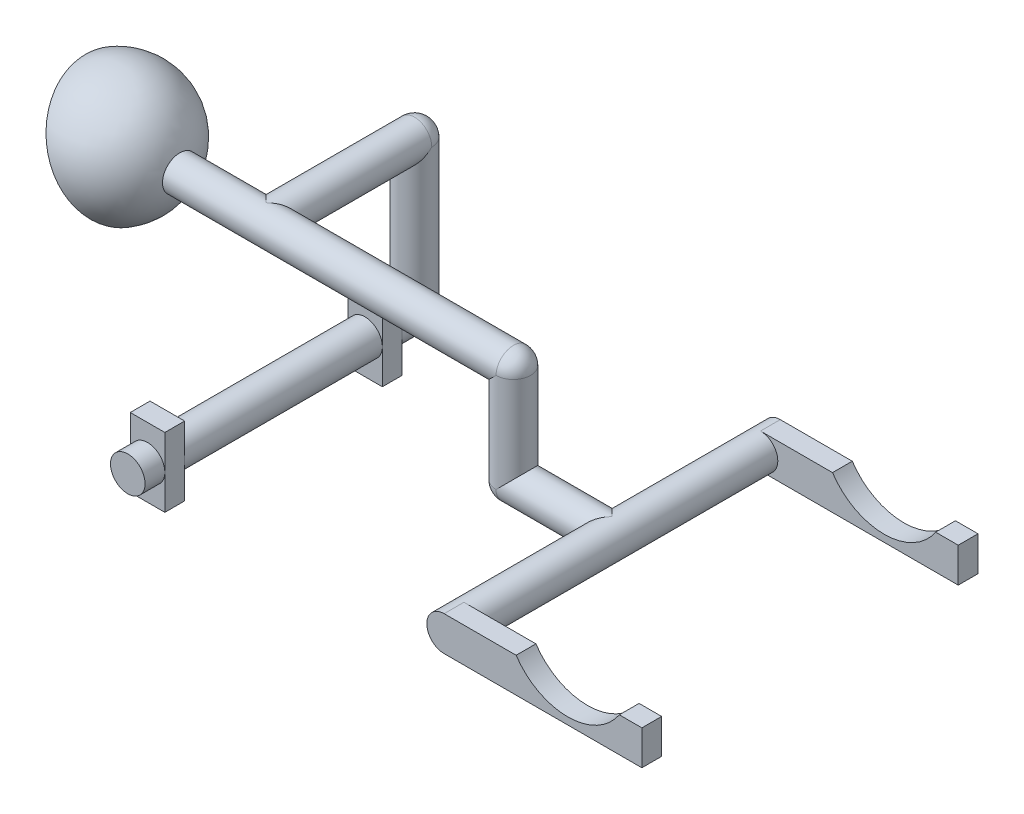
from build123d import *

# Parameters (mm, degrees)
EXTRUSION1_DEPTH             = 50
EXTRUSION1_DEPTH_BACK        = 30
ESQUISSE1_R                  = 3.5
ESQUISSE2_R                  = 3.5
EXTRUSION2_DEPTH             = 30
ESQUISSE3_R                  = 3.5
EXTRUSION3_DEPTH             = 30
ESQUISSE4_W                  = 6
ESQUISSE4_H                  = 3.5
ESQUISSE5_W                  = 7
ESQUISSE5_H                  = 14
EXTRUSION4_DEPTH             = 4
EXTRUSION5_DEPTH             = 40
EXTRUSION6_DEPTH             = 4
EXTRUSION7_DEPTH             = 4
ESQUISSE11_R                 = 3.5
EXTRUSION8_DEPTH             = 20
ESQUISSE12_W                 = 20
ESQUISSE12_H                 = 3.5
EXTRUSION9_DEPTH             = 30
EXTRUSION9_DEPTH_BACK        = 30
ESQUISSE13_R                 = 3.5
EXTRUSION10_DEPTH            = 4
ENL_V_MAT_EXTRU_1_DEPTH      = 24
ENL_V_MAT_EXTRU_1_DEPTH_BACK = 24


with BuildPart() as part:
    # Esquisse1 → Extrusion1 (new, two sides: drawn at the far end of the back side and taken through both)
    with BuildSketch(Plane(origin=(0, 0, 0), x_dir=(0, 0, -1), z_dir=(1, 0, 0)).offset(-EXTRUSION1_DEPTH_BACK)):
        Circle(ESQUISSE1_R)
    extrude(amount=EXTRUSION1_DEPTH + EXTRUSION1_DEPTH_BACK)

    # Esquisse2 → Extrusion2 (add)
    with BuildSketch(Plane.XY):
        Circle(ESQUISSE2_R)
    extrude(amount=-EXTRUSION2_DEPTH)

    # Esquisse3 → Extrusion3 (add)
    with BuildSketch(Plane(origin=(0, 0, 0), x_dir=(1, 0, 0), z_dir=(0, 1, 0))):
        with Locations(Location((0, 30, 0), (0, 0, 270))):
            Circle(ESQUISSE3_R)
    extrude(amount=-EXTRUSION3_DEPTH)

    # Esquisse4 → R_volution1 (revolve)
    with BuildSketch(Plane(origin=(0, 0, 0), x_dir=(0, 0, -1), z_dir=(1, 0, 0))):
        with Locations((27, -28.25)):
            Rectangle(ESQUISSE4_W, ESQUISSE4_H)
    revolve(axis=Axis((0, -30, -33.30321635), (0, 0, 1)))

    # Esquisse5 → Extrusion4 (add)
    with BuildSketch(Plane.XY.offset(-24)):
        with Locations((0, -30)):
            Rectangle(ESQUISSE5_W, ESQUISSE5_H)
    extrude(amount=EXTRUSION4_DEPTH)

    # Esquisse6 → Extrusion5 (add)
    with BuildSketch(Plane.XY.offset(-20)):
        with BuildLine():
            ThreePointArc((-3.5, -30), (0, -33.5), (3.5, -30))
            ThreePointArc((3.5, -30), (0, -26.5), (-3.5, -30))
        make_face()
    extrude(amount=EXTRUSION5_DEPTH)

    # Esquisse7 → Extrusion6 (add)
    with BuildSketch(Plane.XY.offset(20)):
        Polygon((-3.5, -30), (-3.5, -37), (3.5, -37), (3.5, -30), (3.5, -23), (-3.5, -23), align=None)
    extrude(amount=EXTRUSION6_DEPTH)

    # Esquisse8 → Extrusion7 (add)
    with BuildSketch(Plane.XY.offset(24)):
        with BuildLine():
            ThreePointArc((-3.5, -30), (0, -33.5), (3.5, -30))
            ThreePointArc((3.5, -30), (0, -26.5), (-3.5, -30))
        make_face()
    extrude(amount=EXTRUSION7_DEPTH)

    # Esquisse9 → R_volution2 (revolve)
    with BuildSketch(Plane.XY):
        with BuildLine():
            Line((-30, 13), (-30, -13))
            ThreePointArc((-30, -13), (-17, 0), (-30, 13))
        make_face()
    revolve(axis=Axis((-30, 18.638660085, 0), (0, -1, 0)))

    # Esquisse11 → Extrusion8 (add)
    with BuildSketch(Plane(origin=(0, 0, 0), x_dir=(1, 0, 0), z_dir=(0, 1, 0))):
        with Locations(Location((50, 0, 0), (0, 0, 270))):
            Circle(ESQUISSE11_R)
    extrude(amount=-EXTRUSION8_DEPTH)

    # Esquisse12 → R_volution3 (revolve)
    with BuildSketch(Plane.XY, mode=Mode.PRIVATE) as r_volution3_sk:
        with Locations((60, -18.25)):
            Rectangle(ESQUISSE12_W, ESQUISSE12_H)
    revolve(r_volution3_sk.sketch.rotate(Axis((34.93531801, -20, 0), (1, 0, 0)), 90), axis=Axis((34.93531801, -20, 0), (1, 0, 0)))

    # Esquisse13 → Extrusion9 (add, two sides: drawn at the far end of the back side and taken through both)
    with BuildSketch(Plane.XY.offset(-EXTRUSION9_DEPTH_BACK)):
        with Locations((70, -20)):
            Circle(ESQUISSE13_R)
    extrude(amount=EXTRUSION9_DEPTH + EXTRUSION9_DEPTH_BACK)

    # Esquisse14 → Extrusion10 (add)
    with BuildSketch(Plane.XY.offset(30)):
        with BuildLine():
            Line((70, -16.5), (84.564979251, -16.5))
            ThreePointArc((84.564979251, -16.5), (95, -22.077550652), (105.435020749, -16.5))
            Line((105.435020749, -16.5), (110, -16.5))
            Line((110, -16.5), (110, -23.5))
            Line((110, -23.5), (70, -23.5))
            ThreePointArc((70, -23.5), (66.5, -20), (70, -16.5))
        make_face()
    extrusion10 = extrude(amount=EXTRUSION10_DEPTH)

    # Sym_trie1: Extrusion10 across plane
    add(extrusion10.mirror(Plane.XY))

    # Esquisse15 → Enl_v. mat.-Extru.1 (cut, two sides: drawn at the far end of the back side and taken through both)
    with BuildSketch(Plane.XY.offset(-ENL_V_MAT_EXTRU_1_DEPTH_BACK)):
        with BuildLine():
            Line((-36.528694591, 11.241714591), (-23.471305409, -11.241714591))
            ThreePointArc((-23.471305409, -11.241714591), (-41.241714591, -6.528694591), (-36.528694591, 11.241714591))
        make_face()
    extrude(amount=ENL_V_MAT_EXTRU_1_DEPTH + ENL_V_MAT_EXTRU_1_DEPTH_BACK, mode=Mode.SUBTRACT)

    # Esquisse16 → Enl_vement de mati_re-R_volution1 (revolve, cut)
    with BuildSketch(Plane.XY):
        with BuildLine():
            Line((-40, 0), (-20, 0))
            ThreePointArc((-20, 0), (-30, 10), (-40, 0))
        make_face()
    revolve(axis=Axis((-45.600915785, 0, 0), (1, 0, 0)), mode=Mode.SUBTRACT)

    # Esquisse17 → R_volution4 (revolve)
    with BuildSketch(Plane(origin=(0, 0, -30), x_dir=(-1, 0, 0), z_dir=(0, 0, -1))):
        with BuildLine():
            Line((-3.5, 0), (3.5, 0))
            ThreePointArc((3.5, 0), (0, 3.5), (-3.5, 0))
        make_face()
    revolve(axis=Axis((11.869625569, 0, -30), (-1, 0, 0)))

    # Esquisse18 → R_volution5 (revolve)
    with BuildSketch(Plane(origin=(0, 0, -30), x_dir=(-1, 0, 0), z_dir=(0, 0, -1))):
        with BuildLine():
            Line((3.5, -30), (-3.5, -30))
            ThreePointArc((-3.5, -30), (0, -33.5), (3.5, -30))
        make_face()
    revolve(axis=Axis((8.236404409, -30, -30), (-1, 0, 0)))

    # Esquisse19 → R_volution6 (revolve)
    with BuildSketch(Plane.ZY.offset(-50)):
        with BuildLine():
            Line((3.5, -20), (-3.5, -20))
            ThreePointArc((-3.5, -20), (0, -23.5), (3.5, -20))
        make_face()
    revolve(axis=Axis((50, -20, -10.849999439), (0, 0, 1)))

    # Esquisse20 → R_volution7 (revolve)
    with BuildSketch(Plane(origin=(0, 0, 0), x_dir=(-1, 0, 0), z_dir=(0, 1, 0))):
        with BuildLine():
            Line((-50, -3.5), (-50, 3.5))
            ThreePointArc((-50, 3.5), (-53.5, 0), (-50, -3.5))
        make_face()
    revolve(axis=Axis((50, 0, 14.228302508), (0, 0, -1)))


solid = part.part
